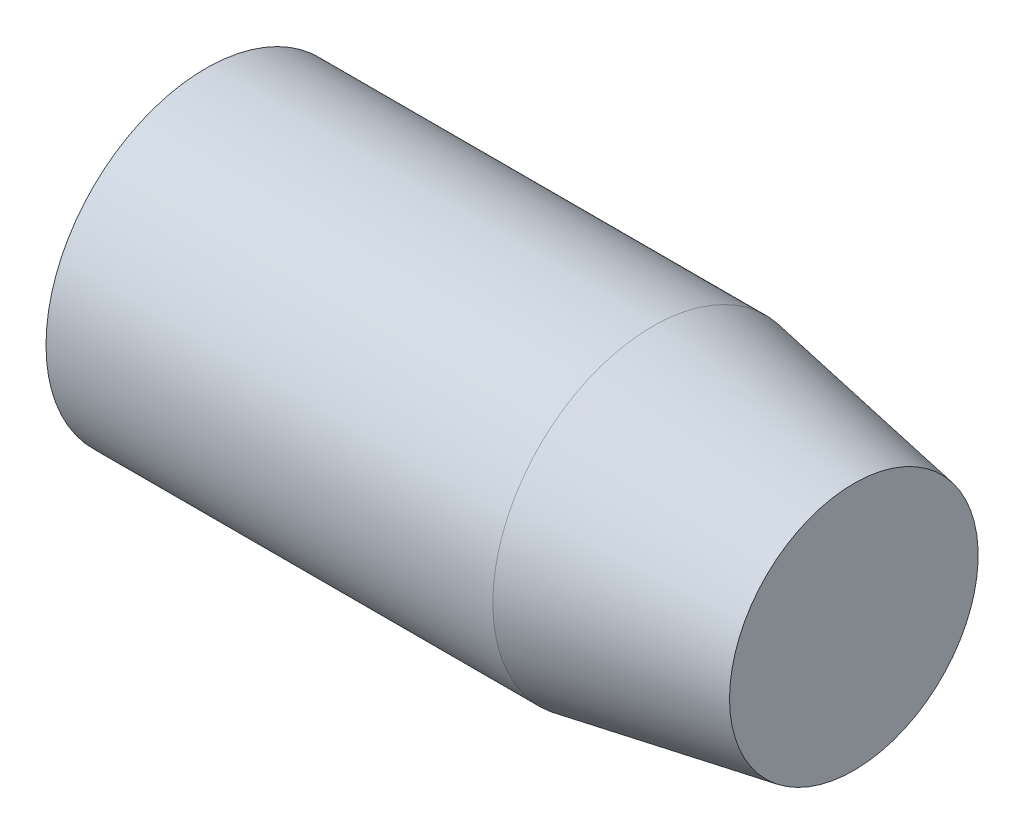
ISO-10303-21;
HEADER;
FILE_DESCRIPTION(('STEP AP214'),'2;1');
FILE_NAME('part.step','',(''),(''),'','','');
FILE_SCHEMA(('AUTOMOTIVE_DESIGN { 1 0 10303 214 1 1 1 1 }'));
ENDSEC;
DATA;
#1=APPLICATION_CONTEXT('core data for automotive mechanical design processes');
#2=APPLICATION_PROTOCOL_DEFINITION('international standard','automotive_design',2000,#1);
#3=PRODUCT_CONTEXT('',#1,'mechanical');
#4=PRODUCT('Part','Part','',(#3));
#5=PRODUCT_RELATED_PRODUCT_CATEGORY('part','',(#4));
#6=PRODUCT_DEFINITION_FORMATION('','',#4);
#7=PRODUCT_DEFINITION_CONTEXT('part definition',#1,'design');
#8=PRODUCT_DEFINITION('design','',#6,#7);
#9=PRODUCT_DEFINITION_SHAPE('','',#8);
#10=(LENGTH_UNIT() NAMED_UNIT(*) SI_UNIT(.MILLI.,.METRE.));
#11=(NAMED_UNIT(*) PLANE_ANGLE_UNIT() SI_UNIT($,.RADIAN.));
#12=(NAMED_UNIT(*) SI_UNIT($,.STERADIAN.) SOLID_ANGLE_UNIT());
#13=UNCERTAINTY_MEASURE_WITH_UNIT(LENGTH_MEASURE(1.E-05),#10,'distance_accuracy_value','');
#14=(GEOMETRIC_REPRESENTATION_CONTEXT(3) GLOBAL_UNCERTAINTY_ASSIGNED_CONTEXT((#13)) GLOBAL_UNIT_ASSIGNED_CONTEXT((#10,
#11,#12)) REPRESENTATION_CONTEXT('',''));
#15=CARTESIAN_POINT('',(0.,0.,0.));
#16=DIRECTION('',(0.,0.,1.));
#17=DIRECTION('',(1.,0.,0.));
#18=AXIS2_PLACEMENT_3D('',#15,#16,#17);
#19=CARTESIAN_POINT('',(0.,0.,0.));
#20=DIRECTION('',(1.,0.,0.));
#21=DIRECTION('',(0.,0.,-1.));
#22=AXIS2_PLACEMENT_3D('',#19,#20,#21);
#23=PLANE('',#22);
#24=CARTESIAN_POINT('',(0.,0.,0.));
#25=DIRECTION('',(-1.,0.,0.));
#26=DIRECTION('',(0.,0.,1.));
#27=AXIS2_PLACEMENT_3D('',#24,#25,#26);
#28=CIRCLE('',#27,1.18999);
#29=CARTESIAN_POINT('',(0.,0.,1.18999));
#30=VERTEX_POINT('',#29);
#31=EDGE_CURVE('E10',#30,#30,#28,.T.);
#32=ORIENTED_EDGE('',*,*,#31,.T.);
#33=EDGE_LOOP('',(#32));
#34=FACE_BOUND('',#33,.T.);
#35=ADVANCED_FACE('F31',(#34),#23,.F.);
#36=CARTESIAN_POINT('',(0.,0.,0.));
#37=DIRECTION('',(-1.,0.,0.));
#38=DIRECTION('',(0.,0.,1.));
#39=AXIS2_PLACEMENT_3D('',#36,#37,#38);
#40=CYLINDRICAL_SURFACE('',#39,1.18999);
#41=ORIENTED_EDGE('',*,*,#31,.F.);
#42=EDGE_LOOP('',(#41));
#43=FACE_BOUND('',#42,.T.);
#44=CARTESIAN_POINT('',(3.32743062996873,0.,0.));
#45=DIRECTION('',(-1.,0.,0.));
#46=DIRECTION('',(0.,0.,1.));
#47=AXIS2_PLACEMENT_3D('',#44,#45,#46);
#48=CIRCLE('',#47,1.18999);
#49=CARTESIAN_POINT('',(3.32743062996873,0.,1.18999));
#50=VERTEX_POINT('',#49);
#51=EDGE_CURVE('E37',#50,#50,#48,.T.);
#52=ORIENTED_EDGE('',*,*,#51,.T.);
#53=EDGE_LOOP('',(#52));
#54=FACE_BOUND('',#53,.T.);
#55=ADVANCED_FACE('F56',(#43,#54),#40,.T.);
#56=CARTESIAN_POINT('',(4.826,0.,0.));
#57=DIRECTION('',(-1.,0.,0.));
#58=DIRECTION('',(0.,0.,1.));
#59=AXIS2_PLACEMENT_3D('',#56,#57,#58);
#60=CONICAL_SURFACE('',#59,0.925751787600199,0.174532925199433);
#61=ORIENTED_EDGE('',*,*,#51,.F.);
#62=EDGE_LOOP('',(#61));
#63=FACE_BOUND('',#62,.T.);
#64=CARTESIAN_POINT('',(4.826,0.,0.));
#65=DIRECTION('',(-1.,0.,0.));
#66=DIRECTION('',(0.,0.,1.));
#67=AXIS2_PLACEMENT_3D('',#64,#65,#66);
#68=CIRCLE('',#67,0.925751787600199);
#69=CARTESIAN_POINT('',(4.826,0.,0.925751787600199));
#70=VERTEX_POINT('',#69);
#71=EDGE_CURVE('E41',#70,#70,#68,.T.);
#72=ORIENTED_EDGE('',*,*,#71,.T.);
#73=EDGE_LOOP('',(#72));
#74=FACE_BOUND('',#73,.T.);
#75=ADVANCED_FACE('F48',(#63,#74),#60,.T.);
#76=CARTESIAN_POINT('',(4.826,0.925751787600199,0.));
#77=DIRECTION('',(-1.,0.,0.));
#78=DIRECTION('',(0.,0.,1.));
#79=AXIS2_PLACEMENT_3D('',#76,#77,#78);
#80=PLANE('',#79);
#81=ORIENTED_EDGE('',*,*,#71,.F.);
#82=EDGE_LOOP('',(#81));
#83=FACE_BOUND('',#82,.T.);
#84=ADVANCED_FACE('F50',(#83),#80,.F.);
#85=CLOSED_SHELL('',(#35,#55,#75,#84));
#86=MANIFOLD_SOLID_BREP('B2',#85);
#87=ADVANCED_BREP_SHAPE_REPRESENTATION('',(#18,#86),#14);
#88=SHAPE_DEFINITION_REPRESENTATION(#9,#87);
ENDSEC;
END-ISO-10303-21;
